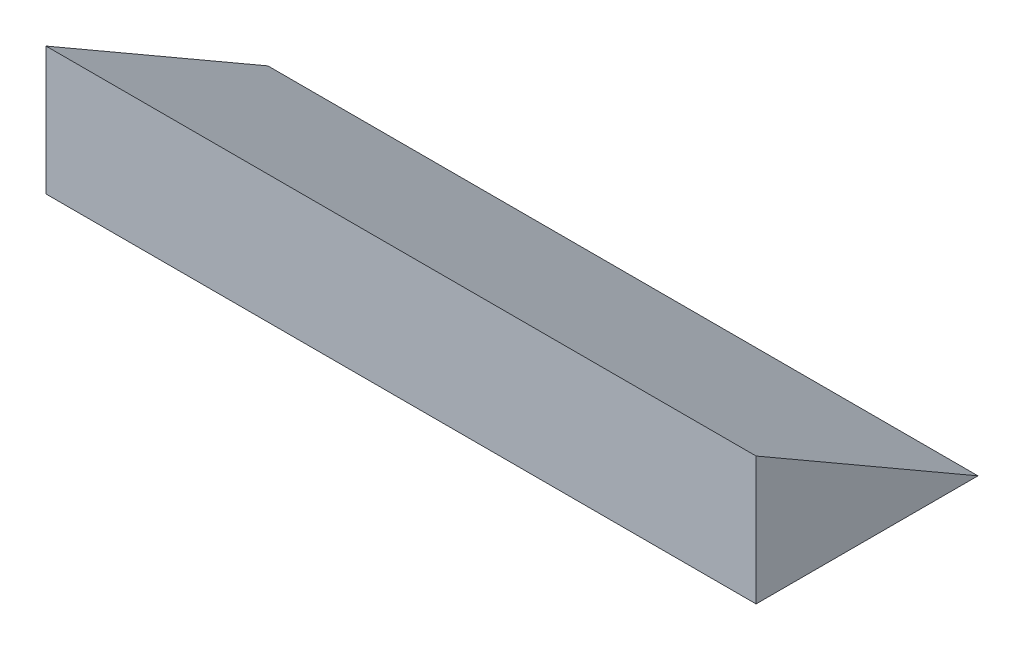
from build123d import *

# Parameters (mm, degrees)
BOSS_EXTRU_1_DEPTH      = 1600
ESQUISSE2_R             = 5
ENL_V_MAT_EXTRU_1_DEPTH = 10


with BuildPart() as part:
    # Esquisse1 → Boss.-Extru.1 (new body)
    with BuildSketch(Plane(origin=(0, 0, 0), x_dir=(0, 0, -1), z_dir=(1, 0, 0))):
        Polygon((0, 0), (500, 0), (0, 288.675134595), align=None)
    extrude(amount=BOSS_EXTRU_1_DEPTH)

    # Esquisse2 → Enl_v. mat.-Extru.1 (cut)
    with BuildSketch(Plane.XZ):
        with Locations(Location((550, -250, 0), (0, 0, 270))):
            Circle(ESQUISSE2_R)
        with Locations(Location((1050, -250, 0), (0, 0, 90))):
            Circle(ESQUISSE2_R)
    extrude(amount=-ENL_V_MAT_EXTRU_1_DEPTH, mode=Mode.SUBTRACT)


solid = part.part
